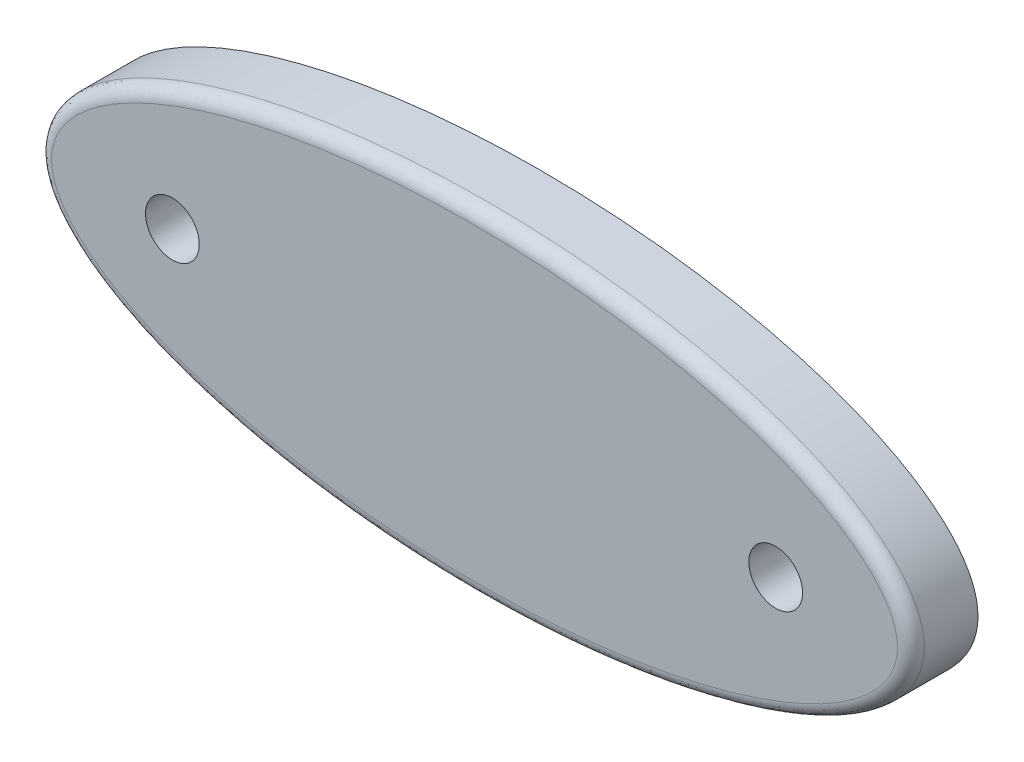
from build123d import *

# Parameters (mm, degrees)
ESQUISSE1_RX            = 65
ESQUISSE1_RY            = 25
ESQUISSE1_R             = 2
EXTRUSION1_DEPTH        = 10
ESQUISSE2_R             = 4
ENL_V_MAT_EXTRU_1_DEPTH = 6
CONG_1_R                = 2
EXTRUSION6_DEPTH        = 10


with BuildPart() as part:
    # Esquisse1 → Extrusion1 (new body)
    with BuildSketch(Plane.XY):
        with Locations(Location((0, 0), (0, 0, 180))):
            Ellipse(ESQUISSE1_RX, ESQUISSE1_RY)
        with Locations((45, 0)):
            Circle(ESQUISSE1_R, mode=Mode.SUBTRACT)
        with Locations((-45, 0)):
            Circle(ESQUISSE1_R, mode=Mode.SUBTRACT)
    extrude(amount=EXTRUSION1_DEPTH)

    # Esquisse2 → Enl_v. mat.-Extru.1 (cut)
    with BuildSketch(Plane.XY.offset(10)):
        with Locations((-45, 0)):
            Circle(ESQUISSE2_R)
        with Locations((44.864681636, 0)):
            Circle(ESQUISSE2_R)
    extrude(amount=-ENL_V_MAT_EXTRU_1_DEPTH, mode=Mode.SUBTRACT)

    # Cong_1
    cong_1_edges = [part.edges().sort_by_distance(p)[0] for p in [
        (64.98861388, 0.467915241, 10),
    ]]
    fillet(cong_1_edges, radius=CONG_1_R)

    # Esquisse3 → Extrusion6 (add)
    with BuildSketch(Plane(origin=(0, 0, 0), x_dir=(-1, 0, 0), z_dir=(0, 0, -1))):
        with BuildLine():
            ThreePointArc((-0.333333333, 0.745355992), (-2, 0), (-0.333333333, -0.745355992))
            ThreePointArc((-0.333333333, -0.745355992), (0, -0.618033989), (0.333333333, -0.745355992))
            ThreePointArc((0.333333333, -0.745355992), (2, 0), (0.333333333, 0.745355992))
            ThreePointArc((0.333333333, 0.745355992), (0, 0.618033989), (-0.333333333, 0.745355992))
        make_face()
    extrude(amount=EXTRUSION6_DEPTH)


solid = part.part
